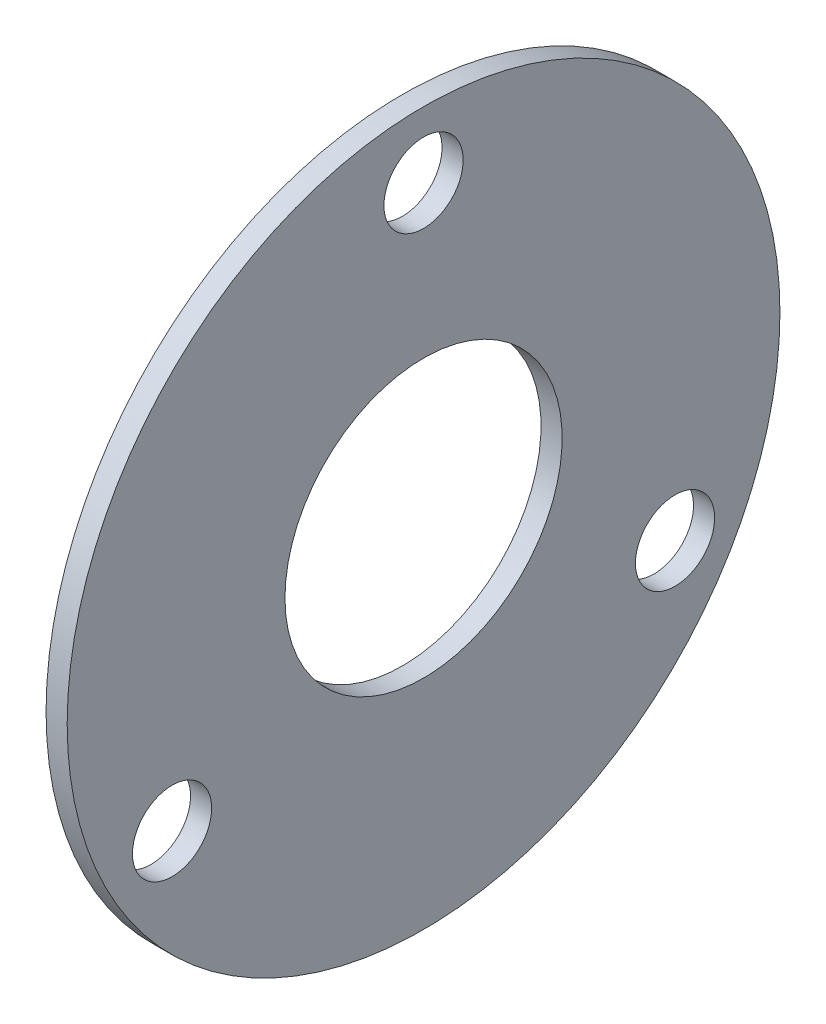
ISO-10303-21;
HEADER;
FILE_DESCRIPTION(('STEP AP214'),'2;1');
FILE_NAME('part.step','',(''),(''),'','','');
FILE_SCHEMA(('AUTOMOTIVE_DESIGN { 1 0 10303 214 1 1 1 1 }'));
ENDSEC;
DATA;
#1=APPLICATION_CONTEXT('core data for automotive mechanical design processes');
#2=APPLICATION_PROTOCOL_DEFINITION('international standard','automotive_design',2000,#1);
#3=PRODUCT_CONTEXT('',#1,'mechanical');
#4=PRODUCT('Part','Part','',(#3));
#5=PRODUCT_RELATED_PRODUCT_CATEGORY('part','',(#4));
#6=PRODUCT_DEFINITION_FORMATION('','',#4);
#7=PRODUCT_DEFINITION_CONTEXT('part definition',#1,'design');
#8=PRODUCT_DEFINITION('design','',#6,#7);
#9=PRODUCT_DEFINITION_SHAPE('','',#8);
#10=(LENGTH_UNIT() NAMED_UNIT(*) SI_UNIT(.MILLI.,.METRE.));
#11=(NAMED_UNIT(*) PLANE_ANGLE_UNIT() SI_UNIT($,.RADIAN.));
#12=(NAMED_UNIT(*) SI_UNIT($,.STERADIAN.) SOLID_ANGLE_UNIT());
#13=UNCERTAINTY_MEASURE_WITH_UNIT(LENGTH_MEASURE(1.E-05),#10,'distance_accuracy_value','');
#14=(GEOMETRIC_REPRESENTATION_CONTEXT(3) GLOBAL_UNCERTAINTY_ASSIGNED_CONTEXT((#13)) GLOBAL_UNIT_ASSIGNED_CONTEXT((#10,
#11,#12)) REPRESENTATION_CONTEXT('',''));
#15=CARTESIAN_POINT('',(0.,0.,0.));
#16=DIRECTION('',(0.,0.,1.));
#17=DIRECTION('',(1.,0.,0.));
#18=AXIS2_PLACEMENT_3D('',#15,#16,#17);
#19=CARTESIAN_POINT('',(-8.1,0.,0.));
#20=DIRECTION('',(1.,0.,0.));
#21=DIRECTION('',(0.,0.,-1.));
#22=AXIS2_PLACEMENT_3D('',#19,#20,#21);
#23=CYLINDRICAL_SURFACE('',#22,13.5);
#24=CARTESIAN_POINT('',(-8.1,0.,0.));
#25=DIRECTION('',(-1.,0.,0.));
#26=DIRECTION('',(0.,0.,1.));
#27=AXIS2_PLACEMENT_3D('',#24,#25,#26);
#28=CIRCLE('',#27,13.5);
#29=CARTESIAN_POINT('',(-8.1,0.,13.5));
#30=VERTEX_POINT('',#29);
#31=EDGE_CURVE('E10',#30,#30,#28,.T.);
#32=ORIENTED_EDGE('',*,*,#31,.F.);
#33=EDGE_LOOP('',(#32));
#34=FACE_BOUND('',#33,.T.);
#35=CARTESIAN_POINT('',(-7.3,0.,0.));
#36=DIRECTION('',(-1.,0.,0.));
#37=DIRECTION('',(0.,0.,1.));
#38=AXIS2_PLACEMENT_3D('',#35,#36,#37);
#39=CIRCLE('',#38,13.5);
#40=CARTESIAN_POINT('',(-7.3,0.,13.5));
#41=VERTEX_POINT('',#40);
#42=EDGE_CURVE('E33',#41,#41,#39,.T.);
#43=ORIENTED_EDGE('',*,*,#42,.T.);
#44=EDGE_LOOP('',(#43));
#45=FACE_BOUND('',#44,.T.);
#46=ADVANCED_FACE('F27',(#34,#45),#23,.T.);
#47=CARTESIAN_POINT('',(-8.1,0.,0.));
#48=DIRECTION('',(-1.,0.,0.));
#49=DIRECTION('',(0.,0.,1.));
#50=AXIS2_PLACEMENT_3D('',#47,#48,#49);
#51=PLANE('',#50);
#52=CARTESIAN_POINT('',(-8.1,0.,0.));
#53=DIRECTION('',(-1.,0.,0.));
#54=DIRECTION('',(0.,0.,1.));
#55=AXIS2_PLACEMENT_3D('',#52,#53,#54);
#56=CIRCLE('',#55,5.25);
#57=CARTESIAN_POINT('',(-8.1,0.,5.25));
#58=VERTEX_POINT('',#57);
#59=EDGE_CURVE('E61',#58,#58,#56,.T.);
#60=ORIENTED_EDGE('',*,*,#59,.F.);
#61=EDGE_LOOP('',(#60));
#62=FACE_BOUND('',#61,.T.);
#63=CARTESIAN_POINT('',(-8.1,-5.49999999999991,-9.52627944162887));
#64=DIRECTION('',(-1.,0.,0.));
#65=DIRECTION('',(0.,0.866025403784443,-0.499999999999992));
#66=AXIS2_PLACEMENT_3D('',#63,#64,#65);
#67=CIRCLE('',#66,1.5);
#68=CARTESIAN_POINT('',(-8.1,-4.20096189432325,-10.2762794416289));
#69=VERTEX_POINT('',#68);
#70=EDGE_CURVE('E55',#69,#69,#67,.T.);
#71=ORIENTED_EDGE('',*,*,#70,.F.);
#72=EDGE_LOOP('',(#71));
#73=FACE_BOUND('',#72,.T.);
#74=CARTESIAN_POINT('',(-8.1,-5.50000000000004,9.5262794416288));
#75=DIRECTION('',(-1.,0.,0.));
#76=DIRECTION('',(0.,-0.866025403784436,-0.500000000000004));
#77=AXIS2_PLACEMENT_3D('',#74,#75,#76);
#78=CIRCLE('',#77,1.5);
#79=CARTESIAN_POINT('',(-8.1,-6.7990381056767,8.7762794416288));
#80=VERTEX_POINT('',#79);
#81=EDGE_CURVE('E49',#80,#80,#78,.T.);
#82=ORIENTED_EDGE('',*,*,#81,.F.);
#83=EDGE_LOOP('',(#82));
#84=FACE_BOUND('',#83,.T.);
#85=CARTESIAN_POINT('',(-8.1,11.,0.));
#86=DIRECTION('',(-1.,0.,0.));
#87=DIRECTION('',(0.,0.,1.));
#88=AXIS2_PLACEMENT_3D('',#85,#86,#87);
#89=CIRCLE('',#88,1.5);
#90=CARTESIAN_POINT('',(-8.1,11.,1.5));
#91=VERTEX_POINT('',#90);
#92=EDGE_CURVE('E41',#91,#91,#89,.T.);
#93=ORIENTED_EDGE('',*,*,#92,.F.);
#94=EDGE_LOOP('',(#93));
#95=FACE_BOUND('',#94,.T.);
#96=ORIENTED_EDGE('',*,*,#31,.T.);
#97=EDGE_LOOP('',(#96));
#98=FACE_BOUND('',#97,.T.);
#99=ADVANCED_FACE('F67',(#62,#73,#84,#95,#98),#51,.T.);
#100=CARTESIAN_POINT('',(-7.3,0.,0.));
#101=DIRECTION('',(-1.,0.,0.));
#102=DIRECTION('',(0.,0.,1.));
#103=AXIS2_PLACEMENT_3D('',#100,#101,#102);
#104=PLANE('',#103);
#105=CARTESIAN_POINT('',(-7.3,0.,0.));
#106=DIRECTION('',(-1.,0.,0.));
#107=DIRECTION('',(0.,0.,1.));
#108=AXIS2_PLACEMENT_3D('',#105,#106,#107);
#109=CIRCLE('',#108,5.25);
#110=CARTESIAN_POINT('',(-7.3,0.,5.25));
#111=VERTEX_POINT('',#110);
#112=EDGE_CURVE('E58',#111,#111,#109,.T.);
#113=ORIENTED_EDGE('',*,*,#112,.T.);
#114=EDGE_LOOP('',(#113));
#115=FACE_BOUND('',#114,.T.);
#116=CARTESIAN_POINT('',(-7.3,-5.49999999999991,-9.52627944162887));
#117=DIRECTION('',(-1.,0.,0.));
#118=DIRECTION('',(0.,0.866025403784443,-0.499999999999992));
#119=AXIS2_PLACEMENT_3D('',#116,#117,#118);
#120=CIRCLE('',#119,1.5);
#121=CARTESIAN_POINT('',(-7.3,-4.20096189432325,-10.2762794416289));
#122=VERTEX_POINT('',#121);
#123=EDGE_CURVE('E52',#122,#122,#120,.T.);
#124=ORIENTED_EDGE('',*,*,#123,.T.);
#125=EDGE_LOOP('',(#124));
#126=FACE_BOUND('',#125,.T.);
#127=CARTESIAN_POINT('',(-7.3,-5.50000000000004,9.5262794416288));
#128=DIRECTION('',(-1.,0.,0.));
#129=DIRECTION('',(0.,-0.866025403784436,-0.500000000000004));
#130=AXIS2_PLACEMENT_3D('',#127,#128,#129);
#131=CIRCLE('',#130,1.5);
#132=CARTESIAN_POINT('',(-7.3,-6.7990381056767,8.7762794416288));
#133=VERTEX_POINT('',#132);
#134=EDGE_CURVE('E46',#133,#133,#131,.T.);
#135=ORIENTED_EDGE('',*,*,#134,.T.);
#136=EDGE_LOOP('',(#135));
#137=FACE_BOUND('',#136,.T.);
#138=CARTESIAN_POINT('',(-7.3,11.,0.));
#139=DIRECTION('',(-1.,0.,0.));
#140=DIRECTION('',(0.,0.,1.));
#141=AXIS2_PLACEMENT_3D('',#138,#139,#140);
#142=CIRCLE('',#141,1.5);
#143=CARTESIAN_POINT('',(-7.3,11.,1.5));
#144=VERTEX_POINT('',#143);
#145=EDGE_CURVE('E37',#144,#144,#142,.T.);
#146=ORIENTED_EDGE('',*,*,#145,.T.);
#147=EDGE_LOOP('',(#146));
#148=FACE_BOUND('',#147,.T.);
#149=ORIENTED_EDGE('',*,*,#42,.F.);
#150=EDGE_LOOP('',(#149));
#151=FACE_BOUND('',#150,.T.);
#152=ADVANCED_FACE('F70',(#115,#126,#137,#148,#151),#104,.F.);
#153=CARTESIAN_POINT('',(-7.3,11.,0.));
#154=DIRECTION('',(-1.,0.,0.));
#155=DIRECTION('',(0.,0.,1.));
#156=AXIS2_PLACEMENT_3D('',#153,#154,#155);
#157=CYLINDRICAL_SURFACE('',#156,1.5);
#158=ORIENTED_EDGE('',*,*,#145,.F.);
#159=EDGE_LOOP('',(#158));
#160=FACE_BOUND('',#159,.T.);
#161=ORIENTED_EDGE('',*,*,#92,.T.);
#162=EDGE_LOOP('',(#161));
#163=FACE_BOUND('',#162,.T.);
#164=ADVANCED_FACE('F77',(#160,#163),#157,.F.);
#165=CARTESIAN_POINT('',(-7.3,-5.50000000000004,9.5262794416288));
#166=DIRECTION('',(-1.,0.,0.));
#167=DIRECTION('',(0.,0.,1.));
#168=AXIS2_PLACEMENT_3D('',#165,#166,#167);
#169=CYLINDRICAL_SURFACE('',#168,1.5);
#170=ORIENTED_EDGE('',*,*,#134,.F.);
#171=EDGE_LOOP('',(#170));
#172=FACE_BOUND('',#171,.T.);
#173=ORIENTED_EDGE('',*,*,#81,.T.);
#174=EDGE_LOOP('',(#173));
#175=FACE_BOUND('',#174,.T.);
#176=ADVANCED_FACE('F79',(#172,#175),#169,.F.);
#177=CARTESIAN_POINT('',(-7.3,-5.49999999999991,-9.52627944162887));
#178=DIRECTION('',(-1.,0.,0.));
#179=DIRECTION('',(0.,0.,1.));
#180=AXIS2_PLACEMENT_3D('',#177,#178,#179);
#181=CYLINDRICAL_SURFACE('',#180,1.5);
#182=ORIENTED_EDGE('',*,*,#123,.F.);
#183=EDGE_LOOP('',(#182));
#184=FACE_BOUND('',#183,.T.);
#185=ORIENTED_EDGE('',*,*,#70,.T.);
#186=EDGE_LOOP('',(#185));
#187=FACE_BOUND('',#186,.T.);
#188=ADVANCED_FACE('F86',(#184,#187),#181,.F.);
#189=CARTESIAN_POINT('',(-7.3,0.,0.));
#190=DIRECTION('',(-1.,0.,0.));
#191=DIRECTION('',(0.,0.,1.));
#192=AXIS2_PLACEMENT_3D('',#189,#190,#191);
#193=CYLINDRICAL_SURFACE('',#192,5.25);
#194=ORIENTED_EDGE('',*,*,#112,.F.);
#195=EDGE_LOOP('',(#194));
#196=FACE_BOUND('',#195,.T.);
#197=ORIENTED_EDGE('',*,*,#59,.T.);
#198=EDGE_LOOP('',(#197));
#199=FACE_BOUND('',#198,.T.);
#200=ADVANCED_FACE('F65',(#196,#199),#193,.F.);
#201=CLOSED_SHELL('',(#46,#99,#152,#164,#176,#188,#200));
#202=MANIFOLD_SOLID_BREP('B2',#201);
#203=ADVANCED_BREP_SHAPE_REPRESENTATION('',(#18,#202),#14);
#204=SHAPE_DEFINITION_REPRESENTATION(#9,#203);
ENDSEC;
END-ISO-10303-21;
